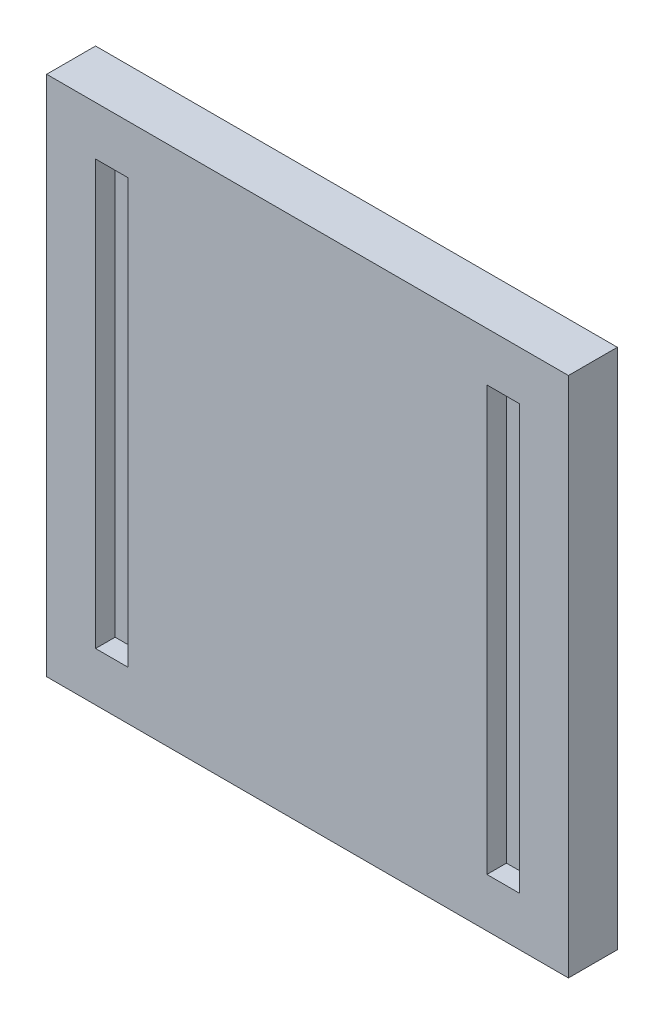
from build123d import *

# Parameters (mm, degrees)
ESQUISSE1_W             = 160
ESQUISSE1_H             = 160
BASE_EXTRUSION_DEPTH    = 15
ESQUISSE2_W             = 10
ESQUISSE2_H             = 130
ENL_V_MAT_EXTRU_2_DEPTH = 6


with BuildPart() as part:
    # Esquisse1 → Base-Extrusion (new body)
    with BuildSketch(Plane.XY):
        with Locations((-16.477961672, -80)):
            Rectangle(ESQUISSE1_W, ESQUISSE1_H)
    extrude(amount=BASE_EXTRUSION_DEPTH)

    # Esquisse2 → Enl_v. mat.-Extru.2 (cut)
    with BuildSketch(Plane.XY.offset(15)):
        with Locations((-76.477961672, -80)):
            Rectangle(ESQUISSE2_W, ESQUISSE2_H)
        with Locations((43.522038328, -80)):
            Rectangle(ESQUISSE2_W, ESQUISSE2_H)
    extrude(amount=-ENL_V_MAT_EXTRU_2_DEPTH, mode=Mode.SUBTRACT)


solid = part.part
